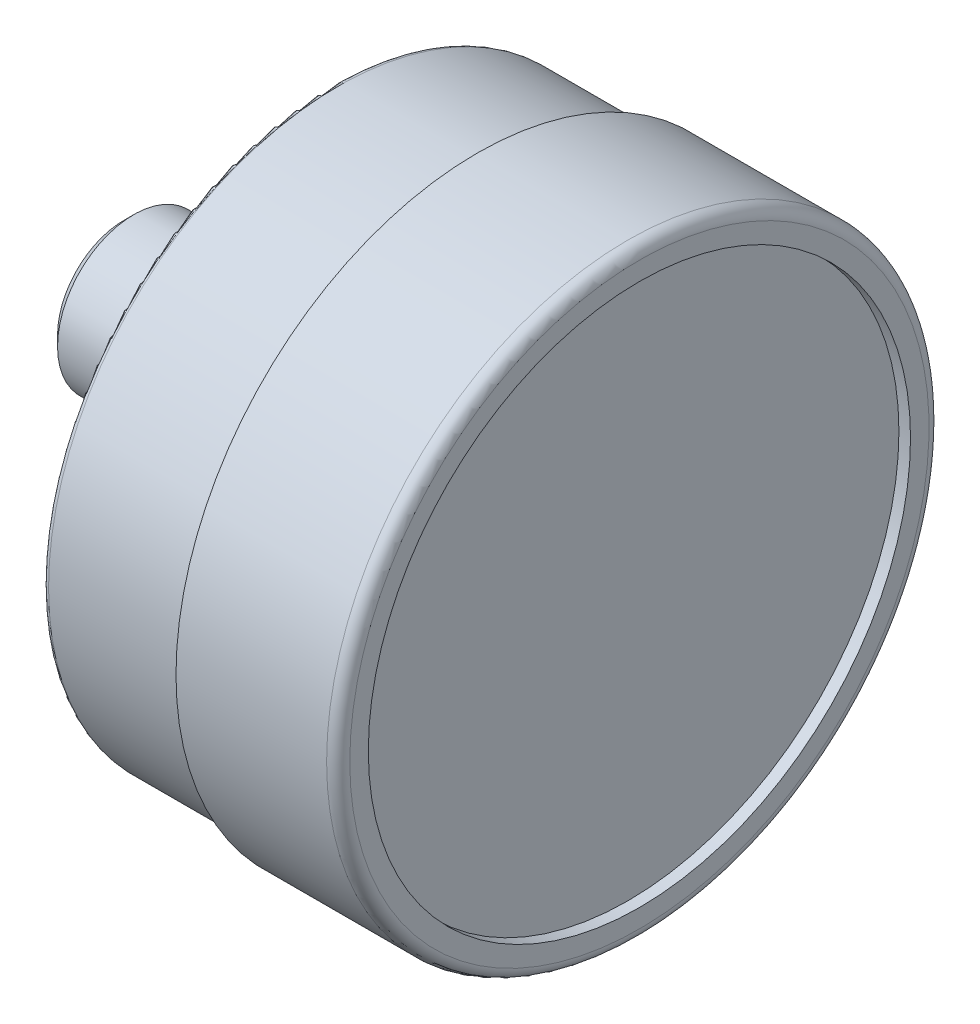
from build123d import *

# Parameters (mm, degrees)
SKETCH_3_R          = 20
SKETCH_3_W          = 13.157
SKETCH_3_H          = 13.157
CUT_EXTRUDE_1_DEPTH = 22.25


with BuildPart() as part:
    # Sketch 1 → Revolve 1 (revolve)
    with BuildSketch(Plane.XY, mode=Mode.PRIVATE) as revolve_1_sk:
        with BuildLine():
            Line((-18, 0), (-18, 5.7225))
            Line((-18, 5.7225), (-17.144, 6.5785))
            Line((-17.144, 6.5785), (0, 6.5785))
            Line((0, 6.5785), (0, 24.5))
            ThreePointArc((0, 24.5), (0.146446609, 24.853553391), (0.5, 25))
            Line((0.5, 25), (12.5, 25))
            Line((12.5, 25), (12.5, 26))
            Line((12.5, 26), (25.5, 26))
            ThreePointArc((25.5, 26), (26.207106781, 25.707106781), (26.5, 25))
            Line((26.5, 25), (26.5, 23.4))
            Line((26.5, 23.4), (25.5, 23.4))
            Line((25.5, 23.4), (25.5, 0))
            Line((25.5, 0), (-18, 0))
        make_face()
    revolve(revolve_1_sk.sketch.rotate(Axis((25.5, 0, 0), (-1, 0, 0)), 270), axis=Axis((25.5, 0, 0), (-1, 0, 0)))

    # Sketch 2 → Revolve 2 (revolve)
    with BuildSketch(Plane.XY, mode=Mode.PRIVATE) as revolve_2_sk:
        with BuildLine():
            Line((-9, 0), (-9, 6.5785))
            ThreePointArc((-9, 6.5785), (-7.081025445, 10.094186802), (-4.5, 13.157))
            Line((-4.5, 13.157), (0, 13.157))
            Line((0, 13.157), (0, 0))
            Line((0, 0), (-9, 0))
        make_face()
    revolve(revolve_2_sk.sketch.rotate(Axis((0, 0, 0), (-1, 0, 0)), 90), axis=Axis((0, 0, 0), (-1, 0, 0)))

    # Sketch 3 → Cut-Extrude 1 (cut)
    with BuildSketch(Plane(origin=(0, 0, 0), x_dir=(0, 0, -1), z_dir=(1, 0, 0))):
        Circle(SKETCH_3_R)
        Rectangle(SKETCH_3_W, SKETCH_3_H, mode=Mode.SUBTRACT)
    extrude(amount=-CUT_EXTRUDE_1_DEPTH, mode=Mode.SUBTRACT)


solid = part.part
